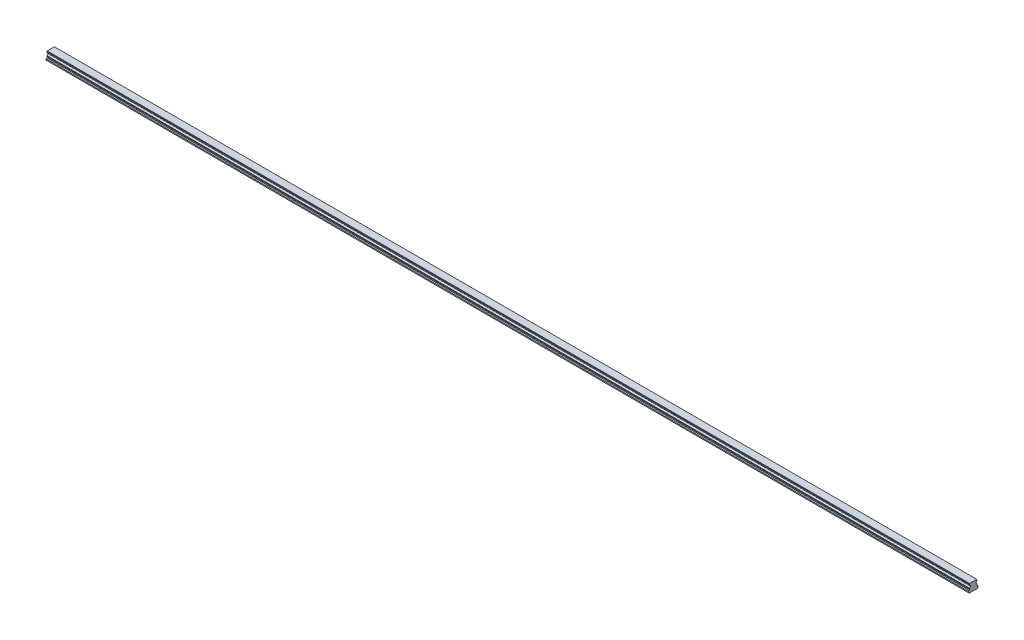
from build123d import *

# Parameters (mm, degrees)
BOSS_EXTRUDE1_DEPTH        = 2400
SKETCH3_R                  = 3
SKETCH3_R_2                = 2.5
CUT_EXTRUDE3_DEPTH         = 12
SKETCH3_2_R                = 2.5
CUT_EXTRUDE4_DEPTH         = 15
CHAMFER1_SIZE              = 0.5
LPATTERN4_COUNT            = 40
LPATTERN4_PITCH            = 60
CHAMFER1_OF_LPATTERN4_SIZE = 0.5


with BuildPart() as part:
    # Sketch1 → Boss-Extrude1 (new body)
    with BuildSketch(Plane(origin=(0, 0, 0), x_dir=(0, 0, -1), z_dir=(1, 0, 0))):
        with BuildLine():
            Line((9.375, 21.8), (-9.375, 21.8))
            Line((-9.375, 21.8), (-9.375, 20.756))
            Line((-9.375, 20.756), (-10, 19.415683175))
            Line((-10, 19.415683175), (-10, 17.685449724))
            ThreePointArc((-10, 17.685449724), (-7.2, 14.6), (-10, 11.514550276))
            Line((-10, 11.514550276), (-10, 9.784316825))
            Line((-10, 9.784316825), (-9.375, 8.444))
            Line((-9.375, 8.444), (-9.922688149, 6.4))
            Line((-9.922688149, 6.4), (-12.5, 5.489338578))
            Line((-12.5, 5.489338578), (-12.5, 2.65))
            Line((-12.5, 2.65), (-9.85, 0))
            Line((-9.85, 0), (-5.5, 0))
            Line((-5.5, 0), (-5, 0.5))
            Line((-5, 0.5), (5, 0.5))
            Line((5, 0.5), (5.5, 0))
            Line((5.5, 0), (9.85, 0))
            Line((9.85, 0), (12.5, 2.65))
            Line((12.5, 2.65), (12.5, 5.489338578))
            Line((12.5, 5.489338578), (9.922688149, 6.4))
            Line((9.922688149, 6.4), (9.375, 8.444))
            Line((9.375, 8.444), (10, 9.784316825))
            Line((10, 9.784316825), (10, 11.514550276))
            ThreePointArc((10, 11.514550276), (7.2, 14.6), (10, 17.685449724))
            Line((10, 17.685449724), (10, 19.415683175))
            Line((10, 19.415683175), (9.375, 20.756))
            Line((9.375, 20.756), (9.375, 21.8))
        make_face()
    extrude(amount=BOSS_EXTRUDE1_DEPTH)

    # Sketch3 → Cut-Extrude3 (cut)
    with BuildSketch(Plane.XZ):
        with Locations(Location((30, 0, 0), (0, 0, 270))):
            Circle(SKETCH3_R)
        with Locations(Location((30, 0, 0), (0, 0, 270))):
            Circle(SKETCH3_R_2, mode=Mode.SUBTRACT)
    cut_extrude3 = extrude(amount=-CUT_EXTRUDE3_DEPTH, mode=Mode.SUBTRACT)

    # Sketch3_2 → Cut-Extrude4 (cut)
    with BuildSketch(Plane.XZ):
        with Locations(Location((30, 0, 0), (0, 0, 270))):
            Circle(SKETCH3_2_R)
    cut_extrude4 = extrude(amount=-CUT_EXTRUDE4_DEPTH, mode=Mode.SUBTRACT)

    # Cut-Extrude5 cone 1 section (on through the dimple's axis) → Cut-Extrude5 (revolve, cut)
    with BuildSketch(Plane(origin=(30, 15, 0), x_dir=(0, 0, -1), z_dir=(1, 0, 0))):
        Polygon((0, 0), (2.5, 0), (0, 1.443375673), align=None)
    cut_extrude5 = revolve(axis=Axis((30, 15, 0), (0, 1, 0)), mode=Mode.SUBTRACT)

    # Chamfer1
    chamfer1_edges = [part.edges().sort_by_distance(p)[0] for p in [
        (30, 0.5, 3),
    ]]
    chamfer(chamfer1_edges, length=CHAMFER1_SIZE)

    # LPattern4: Cut-Extrude3, Cut-Extrude4, Cut-Extrude5 ×40
    with Locations(*[(i * LPATTERN4_PITCH, 0, 0) for i in range(1, LPATTERN4_COUNT)]):
        add(cut_extrude3, mode=Mode.SUBTRACT)
        add(cut_extrude4, mode=Mode.SUBTRACT)
        add(cut_extrude5, mode=Mode.SUBTRACT)

    # Chamfer1 of LPattern4
    chamfer1_of_lpattern4_edges = [part.edges().sort_by_distance(p)[0] for p in [
        (90, 0.5, 3),
        (150, 0.5, 3),
        (210, 0.5, 3),
        (270, 0.5, 3),
        (330, 0.5, 3),
        (390, 0.5, 3),
        (450, 0.5, 3),
        (510, 0.5, 3),
        (570, 0.5, 3),
        (630, 0.5, 3),
        (690, 0.5, 3),
        (750, 0.5, 3),
        (810, 0.5, 3),
        (870, 0.5, 3),
        (930, 0.5, 3),
        (990, 0.5, 3),
        (1050, 0.5, 3),
        (1110, 0.5, 3),
        (1170, 0.5, 3),
        (1230, 0.5, 3),
        (1290, 0.5, 3),
        (1350, 0.5, 3),
        (1410, 0.5, 3),
        (1470, 0.5, 3),
        (1530, 0.5, 3),
        (1590, 0.5, 3),
        (1650, 0.5, 3),
        (1710, 0.5, 3),
        (1770, 0.5, 3),
        (1830, 0.5, 3),
        (1890, 0.5, 3),
        (1950, 0.5, 3),
        (2010, 0.5, 3),
        (2070, 0.5, 3),
        (2130, 0.5, 3),
        (2190, 0.5, 3),
        (2250, 0.5, 3),
        (2310, 0.5, 3),
        (2370, 0.5, 3),
    ]]
    chamfer(chamfer1_of_lpattern4_edges, length=CHAMFER1_OF_LPATTERN4_SIZE)


solid = part.part
